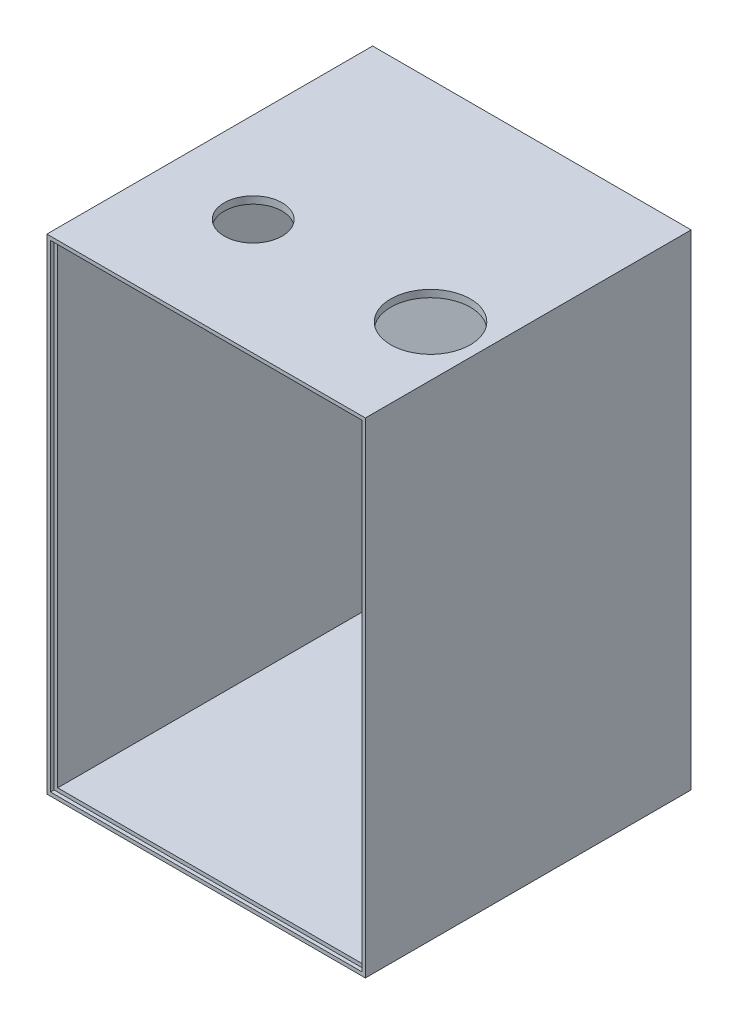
from build123d import *

# Parameters (mm, degrees)
SKIZZE1_W                       = 88
SKIZZE1_H                       = 134
AUFSATZ_LINEAR_AUSTRAGEN1_DEPTH = 2
SKIZZE2_W                       = 88
SKIZZE2_H                       = 134
SKIZZE2_W_2                     = 84
SKIZZE2_H_2                     = 130
AUFSATZ_LINEAR_AUSTRAGEN2_DEPTH = 88
SKIZZE3_W                       = 86
SKIZZE3_H                       = 132
SCHNITT_LINEAR_AUSTRAGEN1_DEPTH = 1
SKIZZE4_R                       = 11
SKIZZE4_R_2                     = 8
SCHNITT_LINEAR_AUSTRAGEN2_DEPTH = 11


with BuildPart() as part:
    # Skizze1 → Aufsatz-Linear austragen1 (new body)
    with BuildSketch(Plane.XY):
        Rectangle(SKIZZE1_W, SKIZZE1_H)
    extrude(amount=AUFSATZ_LINEAR_AUSTRAGEN1_DEPTH)

    # Skizze2 → Aufsatz-Linear austragen2 (add)
    with BuildSketch(Plane.XY.offset(2)):
        Rectangle(SKIZZE2_W, SKIZZE2_H)
        Rectangle(SKIZZE2_W_2, SKIZZE2_H_2, mode=Mode.SUBTRACT)
    extrude(amount=AUFSATZ_LINEAR_AUSTRAGEN2_DEPTH)

    # Skizze3 → Schnitt-Linear austragen1 (cut)
    with BuildSketch(Plane.XY.offset(90)):
        Rectangle(SKIZZE3_W, SKIZZE3_H)
    extrude(amount=-SCHNITT_LINEAR_AUSTRAGEN1_DEPTH, mode=Mode.SUBTRACT)

    # Skizze4 → Schnitt-Linear austragen2 (cut)
    with BuildSketch(Plane(origin=(0, 67, 0), x_dir=(1, 0, 0), z_dir=(0, 1, 0))):
        with Locations(Location((30, -58, 0), (0, 0, 270))):
            Circle(SKIZZE4_R)
        with Locations(Location((-19, -58, 0), (0, 0, 270))):
            Circle(SKIZZE4_R_2)
    extrude(amount=-SCHNITT_LINEAR_AUSTRAGEN2_DEPTH, mode=Mode.SUBTRACT)


solid = part.part
